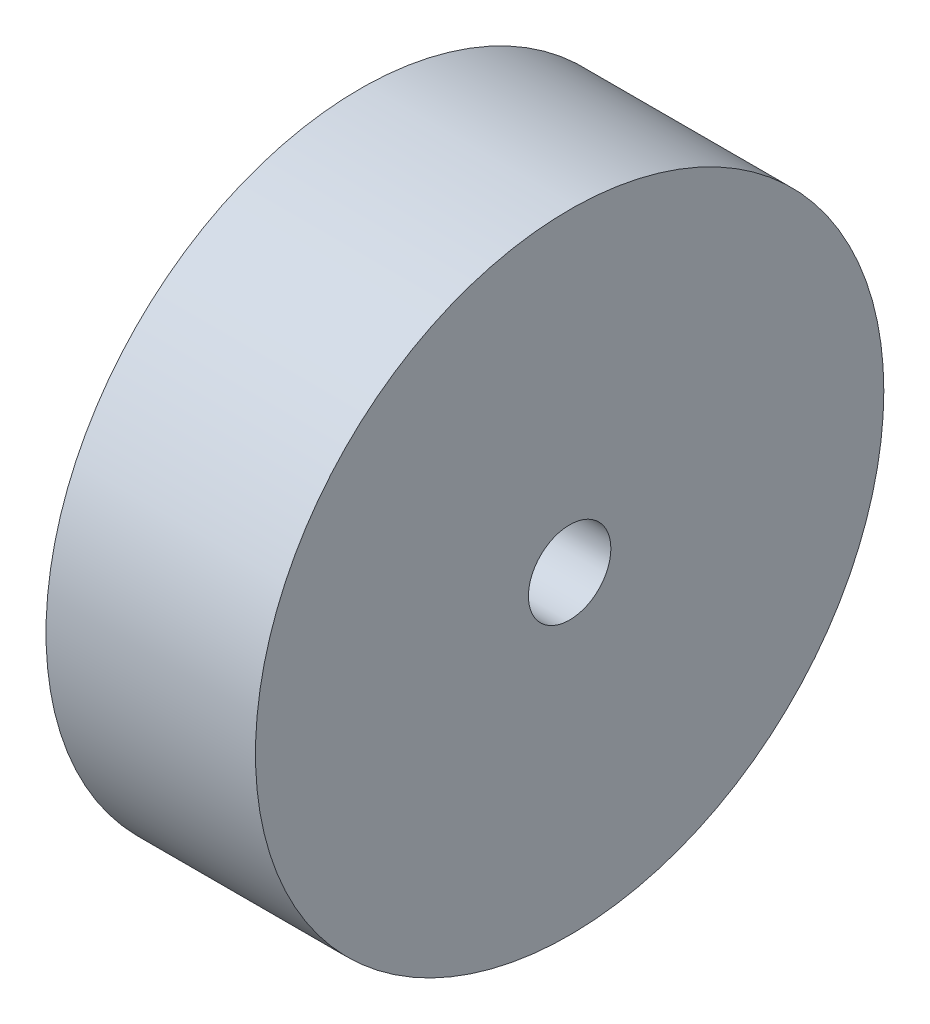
ISO-10303-21;
HEADER;
FILE_DESCRIPTION(('STEP AP214'),'2;1');
FILE_NAME('part.step','',(''),(''),'','','');
FILE_SCHEMA(('AUTOMOTIVE_DESIGN { 1 0 10303 214 1 1 1 1 }'));
ENDSEC;
DATA;
#1=APPLICATION_CONTEXT('core data for automotive mechanical design processes');
#2=APPLICATION_PROTOCOL_DEFINITION('international standard','automotive_design',2000,#1);
#3=PRODUCT_CONTEXT('',#1,'mechanical');
#4=PRODUCT('Part','Part','',(#3));
#5=PRODUCT_RELATED_PRODUCT_CATEGORY('part','',(#4));
#6=PRODUCT_DEFINITION_FORMATION('','',#4);
#7=PRODUCT_DEFINITION_CONTEXT('part definition',#1,'design');
#8=PRODUCT_DEFINITION('design','',#6,#7);
#9=PRODUCT_DEFINITION_SHAPE('','',#8);
#10=(LENGTH_UNIT() NAMED_UNIT(*) SI_UNIT(.MILLI.,.METRE.));
#11=(NAMED_UNIT(*) PLANE_ANGLE_UNIT() SI_UNIT($,.RADIAN.));
#12=(NAMED_UNIT(*) SI_UNIT($,.STERADIAN.) SOLID_ANGLE_UNIT());
#13=UNCERTAINTY_MEASURE_WITH_UNIT(LENGTH_MEASURE(1.E-05),#10,'distance_accuracy_value','');
#14=(GEOMETRIC_REPRESENTATION_CONTEXT(3) GLOBAL_UNCERTAINTY_ASSIGNED_CONTEXT((#13)) GLOBAL_UNIT_ASSIGNED_CONTEXT((#10,
#11,#12)) REPRESENTATION_CONTEXT('',''));
#15=CARTESIAN_POINT('',(0.,0.,0.));
#16=DIRECTION('',(0.,0.,1.));
#17=DIRECTION('',(1.,0.,0.));
#18=AXIS2_PLACEMENT_3D('',#15,#16,#17);
#19=CARTESIAN_POINT('',(25.4,0.,0.));
#20=DIRECTION('',(1.,0.,0.));
#21=DIRECTION('',(0.,0.,-1.));
#22=AXIS2_PLACEMENT_3D('',#19,#20,#21);
#23=PLANE('',#22);
#24=CARTESIAN_POINT('',(25.4,0.,0.));
#25=DIRECTION('',(1.,0.,0.));
#26=DIRECTION('',(0.,0.,-1.));
#27=AXIS2_PLACEMENT_3D('',#24,#25,#26);
#28=CIRCLE('',#27,38.1);
#29=CARTESIAN_POINT('',(25.4,0.,-38.1));
#30=VERTEX_POINT('',#29);
#31=EDGE_CURVE('E10',#30,#30,#28,.T.);
#32=ORIENTED_EDGE('',*,*,#31,.T.);
#33=EDGE_LOOP('',(#32));
#34=FACE_BOUND('',#33,.T.);
#35=CARTESIAN_POINT('',(25.4,0.,0.));
#36=DIRECTION('',(1.,0.,0.));
#37=DIRECTION('',(0.,0.,-1.));
#38=AXIS2_PLACEMENT_3D('',#35,#36,#37);
#39=CIRCLE('',#38,5.);
#40=CARTESIAN_POINT('',(25.4,0.,-5.));
#41=VERTEX_POINT('',#40);
#42=EDGE_CURVE('E59',#41,#41,#39,.T.);
#43=ORIENTED_EDGE('',*,*,#42,.F.);
#44=EDGE_LOOP('',(#43));
#45=FACE_BOUND('',#44,.T.);
#46=ADVANCED_FACE('F45',(#34,#45),#23,.T.);
#47=CARTESIAN_POINT('',(0.,0.,0.));
#48=DIRECTION('',(1.,0.,0.));
#49=DIRECTION('',(0.,0.,-1.));
#50=AXIS2_PLACEMENT_3D('',#47,#48,#49);
#51=PLANE('',#50);
#52=CARTESIAN_POINT('',(0.,0.,0.));
#53=DIRECTION('',(1.,0.,0.));
#54=DIRECTION('',(0.,0.,-1.));
#55=AXIS2_PLACEMENT_3D('',#52,#53,#54);
#56=CIRCLE('',#55,38.1);
#57=CARTESIAN_POINT('',(0.,0.,-38.1));
#58=VERTEX_POINT('',#57);
#59=EDGE_CURVE('E49',#58,#58,#56,.T.);
#60=ORIENTED_EDGE('',*,*,#59,.F.);
#61=EDGE_LOOP('',(#60));
#62=FACE_BOUND('',#61,.T.);
#63=CARTESIAN_POINT('',(0.,0.,0.));
#64=DIRECTION('',(1.,0.,0.));
#65=DIRECTION('',(0.,0.,-1.));
#66=AXIS2_PLACEMENT_3D('',#63,#64,#65);
#67=CIRCLE('',#66,5.);
#68=CARTESIAN_POINT('',(0.,0.,-5.));
#69=VERTEX_POINT('',#68);
#70=EDGE_CURVE('E61',#69,#69,#67,.T.);
#71=ORIENTED_EDGE('',*,*,#70,.T.);
#72=EDGE_LOOP('',(#71));
#73=FACE_BOUND('',#72,.T.);
#74=ADVANCED_FACE('F74',(#62,#73),#51,.F.);
#75=CARTESIAN_POINT('',(25.4,0.,0.));
#76=DIRECTION('',(-1.,0.,0.));
#77=DIRECTION('',(0.,0.,1.));
#78=AXIS2_PLACEMENT_3D('',#75,#76,#77);
#79=CYLINDRICAL_SURFACE('',#78,38.1);
#80=ORIENTED_EDGE('',*,*,#31,.F.);
#81=EDGE_LOOP('',(#80));
#82=FACE_BOUND('',#81,.T.);
#83=ORIENTED_EDGE('',*,*,#59,.T.);
#84=EDGE_LOOP('',(#83));
#85=FACE_BOUND('',#84,.T.);
#86=ADVANCED_FACE('F47',(#82,#85),#79,.T.);
#87=CARTESIAN_POINT('',(25.4,0.,0.));
#88=DIRECTION('',(-1.,0.,0.));
#89=DIRECTION('',(0.,0.,1.));
#90=AXIS2_PLACEMENT_3D('',#87,#88,#89);
#91=CYLINDRICAL_SURFACE('',#90,5.);
#92=ORIENTED_EDGE('',*,*,#42,.T.);
#93=EDGE_LOOP('',(#92));
#94=FACE_BOUND('',#93,.T.);
#95=ORIENTED_EDGE('',*,*,#70,.F.);
#96=EDGE_LOOP('',(#95));
#97=FACE_BOUND('',#96,.T.);
#98=ADVANCED_FACE('F70',(#94,#97),#91,.F.);
#99=CLOSED_SHELL('',(#46,#74,#86,#98));
#100=MANIFOLD_SOLID_BREP('B2',#99);
#101=ADVANCED_BREP_SHAPE_REPRESENTATION('',(#18,#100),#14);
#102=SHAPE_DEFINITION_REPRESENTATION(#9,#101);
ENDSEC;
END-ISO-10303-21;
